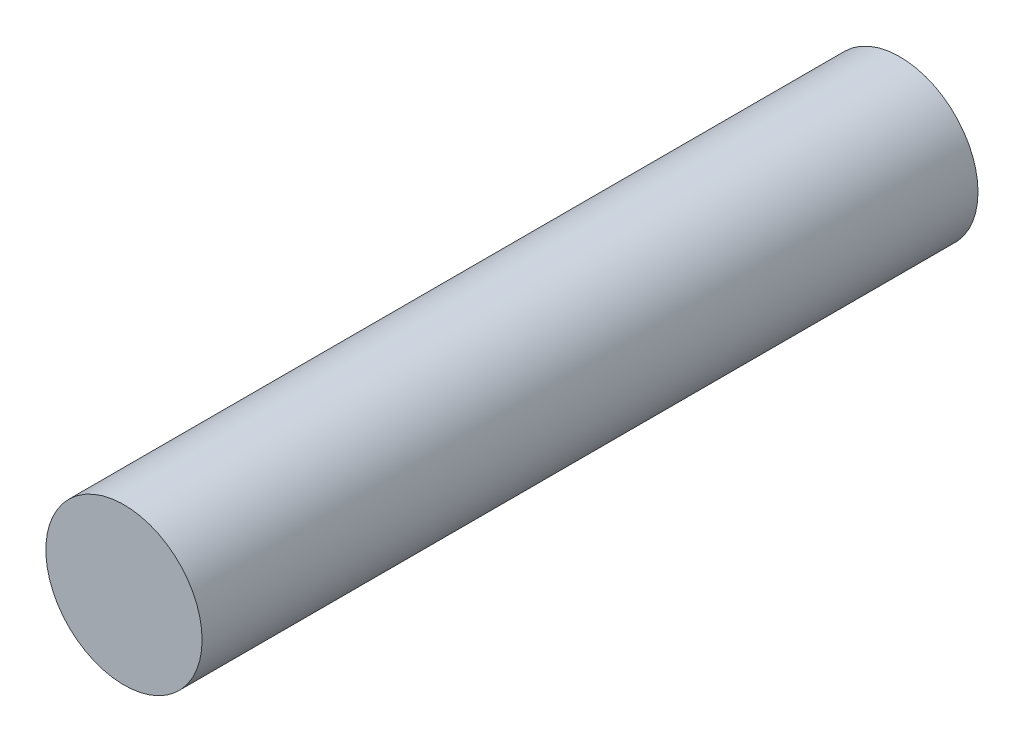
from build123d import *

# Parameters (mm, degrees)
SKETCH1_R           = 75
BOSS_EXTRUDE1_DEPTH = 372.5


with BuildPart() as part:
    # Sketch1 → Boss-Extrude1 (new, symmetric)
    with BuildSketch(Plane.XY):
        Circle(SKETCH1_R)
    extrude(amount=BOSS_EXTRUDE1_DEPTH, both=True)


solid = part.part
